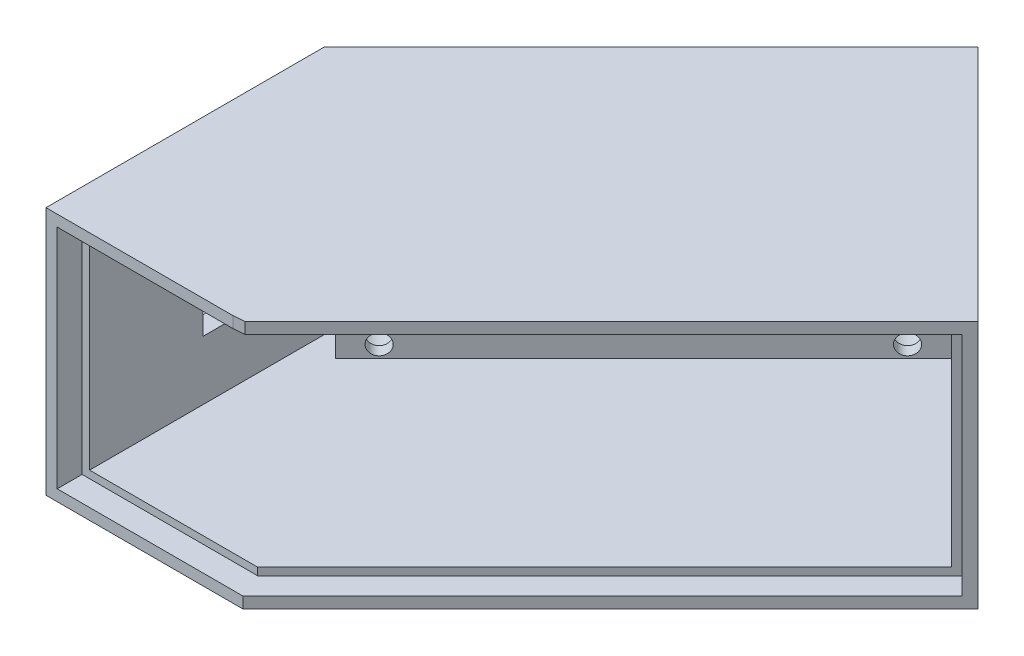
from build123d import *

# Parameters (mm, degrees)
BOSS_EXTRUDE1_DEPTH = 40
SHELL1_T            = -3
BOSS_EXTRUDE2_DEPTH = 4
BOSS_EXTRUDE3_DEPTH = 4
BOSS_EXTRUDE4_DEPTH = 1.8
BOSS_EXTRUDE5_DEPTH = 1.8
SKETCH10_R          = 1.6
CUT_EXTRUDE6_DEPTH  = 107.30423742
SKETCH11_W          = 12.8
SKETCH11_H          = 15
CUT_EXTRUDE7_DEPTH  = 3
BOSS_EXTRUDE7_START = 6
SKETCH12_W          = 69.967359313
SKETCH12_H          = 34
SKETCH12_R          = 1.6
BOSS_EXTRUDE7_DEPTH = 6
SKETCH13_R          = 3.1
CUT_EXTRUDE9_DEPTH  = 7
SKETCH14_W          = 60
SKETCH14_H          = 22
CUT_EXTRUDE10_DEPTH = 6
CHAMFER1_SIZE       = 2


with BuildPart() as part:
    # Sketch1 → Boss-Extrude1 (new body)
    with BuildSketch(Plane(origin=(0, 0, 0), x_dir=(1, 0, 0), z_dir=(0, 1, 0))):
        Polygon((-43.359374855, -5.394325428), (-43.359374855, 35.316352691), (9.115019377, 87.790746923), (44.470358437, 52.435407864), (-13.359374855, -5.394325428), align=None)
    extrude(amount=BOSS_EXTRUDE1_DEPTH)

    # Shell1
    shell1_openings = [part.faces().sort_by_distance(p)[0] for p in [
        (15.555491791, 20, -23.520541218),
        (-28.359374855, 20, 5.394325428),
    ]]
    offset(amount=SHELL1_T, openings=shell1_openings, kind=Kind.INTERSECTION)

    # Sketch6 → Boss-Extrude2 (add)
    with BuildSketch(Plane(origin=(-3.982524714, 0, -3.982524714), x_dir=(0.7071067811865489, 0, -0.7071067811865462), z_dir=(0.7071067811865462, 0, 0.7071067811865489))):
        Polygon((-13.260868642, 38.2), (66.722724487, 38.2), (66.722724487, 1.8), (-13.260868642, 1.8), (-13.260868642, 0), (68.522724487, 0), (68.522724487, 40), (-13.260868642, 40), align=None)
    extrude(amount=BOSS_EXTRUDE2_DEPTH)

    # Sketch7 → Boss-Extrude3 (add)
    with BuildSketch(Plane.XY.offset(5.394325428)):
        Polygon((-13.359374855, 1.8), (-41.559374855, 1.8), (-41.559374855, 38.2), (-13.359374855, 38.2), (-13.359374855, 40), (-43.359374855, 40), (-43.359374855, 0), (-13.359374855, 0), align=None)
    extrude(amount=BOSS_EXTRUDE3_DEPTH)

    # Sketch8 → Boss-Extrude4 (add)
    with BuildSketch(Plane.XZ):
        Polygon((-13.359374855, 9.394325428), (-11.702520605, 9.394325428), (-10.53094773, 8.222752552), (-13.359374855, 5.394325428), align=None)
    extrude(amount=-BOSS_EXTRUDE4_DEPTH)

    # Sketch9 → Boss-Extrude5 (add)
    with BuildSketch(Plane(origin=(0, 40, 0), x_dir=(1, 0, 0), z_dir=(0, 1, 0))):
        Polygon((-13.359374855, -5.394325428), (-10.53094773, -8.222752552), (-11.553745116, -9.245549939), (-13.359374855, -9.394325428), align=None)
    extrude(amount=-BOSS_EXTRUDE5_DEPTH)

    # Sketch10 → Cut-Extrude6 (cut, through all)
    with BuildSketch(Plane(origin=(-37.216543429, 0, -37.216543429), x_dir=(0.7071067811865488, 0, -0.7071067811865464), z_dir=(0.7071067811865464, 0, 0.7071067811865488))):
        with Locations((60.522724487, 35)):
            Circle(SKETCH10_R)
        with Locations((60.522724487, 5)):
            Circle(SKETCH10_R)
        with Locations((0.522724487, 35)):
            Circle(SKETCH10_R)
        with Locations((0.522724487, 5)):
            Circle(SKETCH10_R)
    extrude(amount=-CUT_EXTRUDE6_DEPTH, mode=Mode.SUBTRACT)

    # Sketch11 → Cut-Extrude7 (cut)
    with BuildSketch(Plane(origin=(-40.359374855, 0, 0), x_dir=(0, 0, -1), z_dir=(1, 0, 0))):
        with Locations((19.207640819, 20)):
            Rectangle(SKETCH11_W, SKETCH11_H)
    extrude(amount=-CUT_EXTRUDE7_DEPTH, mode=Mode.SUBTRACT)

    # Sketch12 → Boss-Extrude7 (add)
    with BuildSketch(Plane(origin=(-37.216543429, 0, -37.216543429), x_dir=(0.7071067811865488, 0, -0.7071067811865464), z_dir=(0.7071067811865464, 0, 0.7071067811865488)).offset(BOSS_EXTRUDE7_START)):
        with Locations((30.539044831, 20)):
            Rectangle(SKETCH12_W, SKETCH12_H)
        with Locations((0.522724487, 35)):
            Circle(SKETCH12_R, mode=Mode.SUBTRACT)
        with Locations((60.522724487, 35)):
            Circle(SKETCH12_R, mode=Mode.SUBTRACT)
        with Locations((60.522724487, 5)):
            Circle(SKETCH12_R, mode=Mode.SUBTRACT)
        with Locations((0.522724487, 5)):
            Circle(SKETCH12_R, mode=Mode.SUBTRACT)
    extrude(amount=-BOSS_EXTRUDE7_DEPTH)

    # Sketch13 → Cut-Extrude9 (cut)
    with BuildSketch(Plane(origin=(-39.337863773, 0, -39.337863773), x_dir=(-0.7071067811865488, 0, 0.7071067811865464), z_dir=(-0.7071067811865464, 0, -0.7071067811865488))):
        with Locations((-0.522724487, 35)):
            Circle(SKETCH13_R)
        with Locations((-0.522724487, 5)):
            Circle(SKETCH13_R)
        with Locations((-60.522724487, 5)):
            Circle(SKETCH13_R)
        with Locations((-60.522724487, 35)):
            Circle(SKETCH13_R)
    extrude(amount=-CUT_EXTRUDE9_DEPTH, mode=Mode.SUBTRACT)

    # Sketch14 → Cut-Extrude10 (cut)
    with BuildSketch(Plane(origin=(-32.973902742, 0, -32.973902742), x_dir=(0.7071067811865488, 0, -0.7071067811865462), z_dir=(0.7071067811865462, 0, 0.7071067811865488))):
        with Locations((30.53904483, 20)):
            Rectangle(SKETCH14_W, SKETCH14_H)
    extrude(amount=-CUT_EXTRUDE10_DEPTH, mode=Mode.SUBTRACT)

    # Chamfer1
    chamfer1_edges = [part.edges().sort_by_distance(p)[0] for p in [
        (-32.592740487, 20, -33.355064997),
        (-11.379537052, 9, -54.568268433),
        (9.833666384, 20, -75.781471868),
        (-11.379537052, 31, -54.568268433),
    ]]
    chamfer(chamfer1_edges, length=CHAMFER1_SIZE)


solid = part.part
